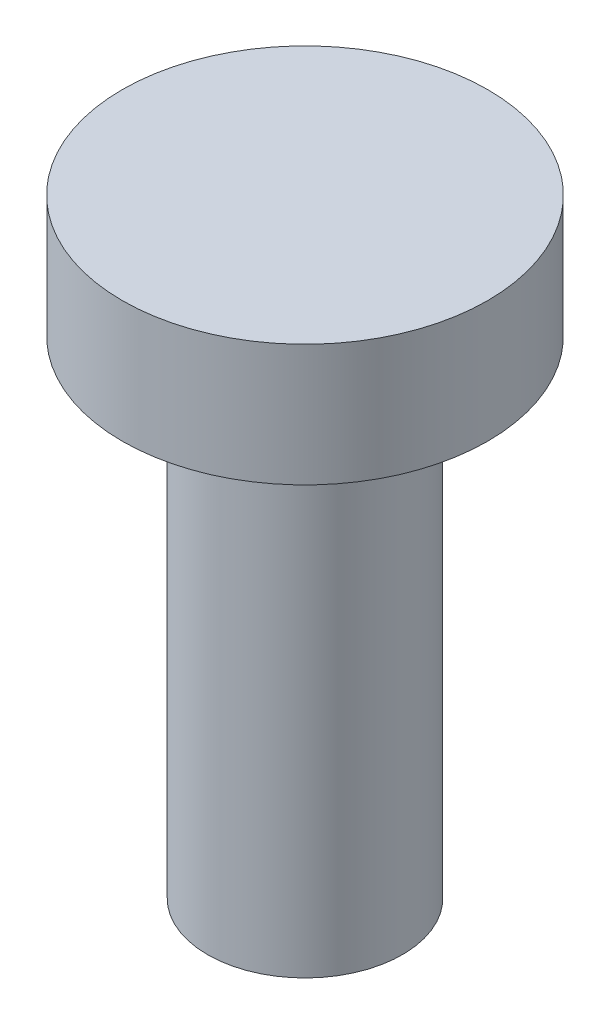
from build123d import *

# Parameters (mm, degrees)
SKETCH1_R          = 5.08
EXTRUDE1_DEPTH     = 25.4
SKETCH2_R          = 9.525
EXTRUDE2_DEPTH     = 6.35
SKETCH6_R          = 2.286
CUT_EXTRUDE1_DEPTH = 6.35


with BuildPart() as part:
    # Sketch1 → Extrude1 (new body)
    with BuildSketch(Plane(origin=(0, 0, 0), x_dir=(1, 0, 0), z_dir=(0, 1, 0))):
        with Locations(Location((0, 0, 0), (0, 0, 270))):
            Circle(SKETCH1_R)
    extrude(amount=EXTRUDE1_DEPTH)

    # Sketch2 → Extrude2 (add)
    with BuildSketch(Plane(origin=(0, 25.4, 0), x_dir=(-1, 0, 0), z_dir=(0, 1, 0))):
        with Locations(Location((0, 0, 0), (0, 0, 90))):
            Circle(SKETCH2_R)
    extrude(amount=EXTRUDE2_DEPTH)

    # Sketch6 → Cut-Extrude1 (cut)
    with BuildSketch(Plane.XZ):
        with Locations(Location((0, 0, 0), (0, 0, 270))):
            Circle(SKETCH6_R)
    extrude(amount=-CUT_EXTRUDE1_DEPTH, mode=Mode.SUBTRACT)


solid = part.part
